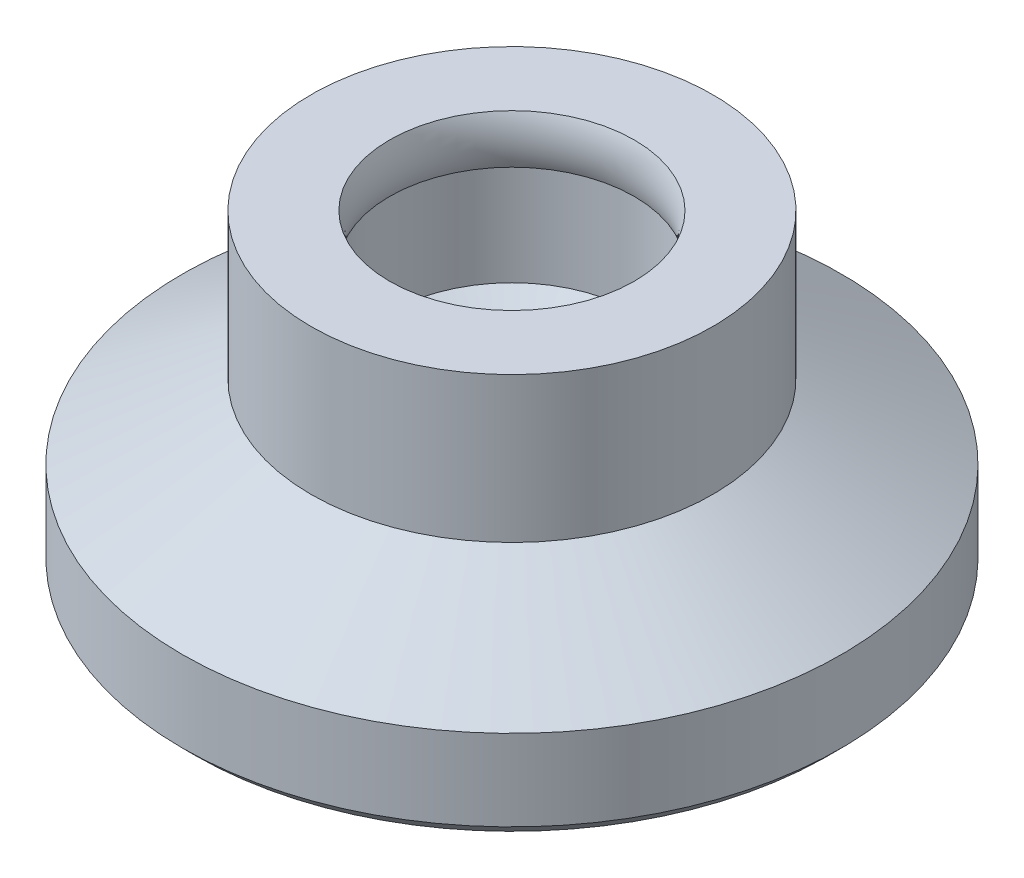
from build123d import *

# Parameters (mm, degrees)
SKETCH1_R      = 6.4
EXTRUDE1_DEPTH = 5
SKETCH3_R      = 10.5
EXTRUDE2_DEPTH = 3
CHAMFER1_SIZE  = 0.42


with BuildPart() as part:
    # Sketch1 → Extrude1 (new, symmetric)
    with BuildSketch(Plane(origin=(0, 0, 0), x_dir=(1, 0, 0), z_dir=(0, 1, 0))):
        with Locations(Location((0, 0, 0), (0, 0, 270))):
            Circle(SKETCH1_R)
    extrude(amount=EXTRUDE1_DEPTH, both=True)

    # Sketch3 → Extrude2 (add)
    with BuildSketch(Plane.XZ.offset(5)):
        with Locations(Location((0, 0, 0), (0, 0, 270))):
            Circle(SKETCH3_R)
    extrude(amount=-EXTRUDE2_DEPTH)

    # Sketch4 → Revolve1 (revolve)
    with BuildSketch(Plane.XY, mode=Mode.PRIVATE) as revolve1_sk:
        Polygon((-10.5, -2), (-6.4, 0.367136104), (-6.4, -2), align=None)
    revolve(revolve1_sk.sketch.rotate(Axis((0, 5, 0), (0, -1, 0)), 270), axis=Axis((0, 5, 0), (0, -1, 0)))

    # Chamfer1
    chamfer1_edges = [part.edges().sort_by_distance(p)[0] for p in [
        (0, -5, 10.5),
    ]]
    chamfer(chamfer1_edges, length=CHAMFER1_SIZE)

    # Sketch5 → Cut-Revolve1 (revolve, cut)
    with BuildSketch(Plane.XY, mode=Mode.PRIVATE) as cut_revolve1_sk:
        with BuildLine():
            Line((0, 5), (3.9, 5))
            ThreePointArc((3.9, 5), (3.744, 4.22), (3.9, 3.44))
            Line((3.9, 3.44), (3.9, 0.25166605))
            Line((3.9, 0.25166605), (0, -2))
            Line((0, -2), (0, 5))
        make_face()
    revolve(cut_revolve1_sk.sketch.rotate(Axis((0, 0, 0), (0, 1, 0)), 270), axis=Axis((0, 0, 0), (0, 1, 0)), mode=Mode.SUBTRACT)


solid = part.part
